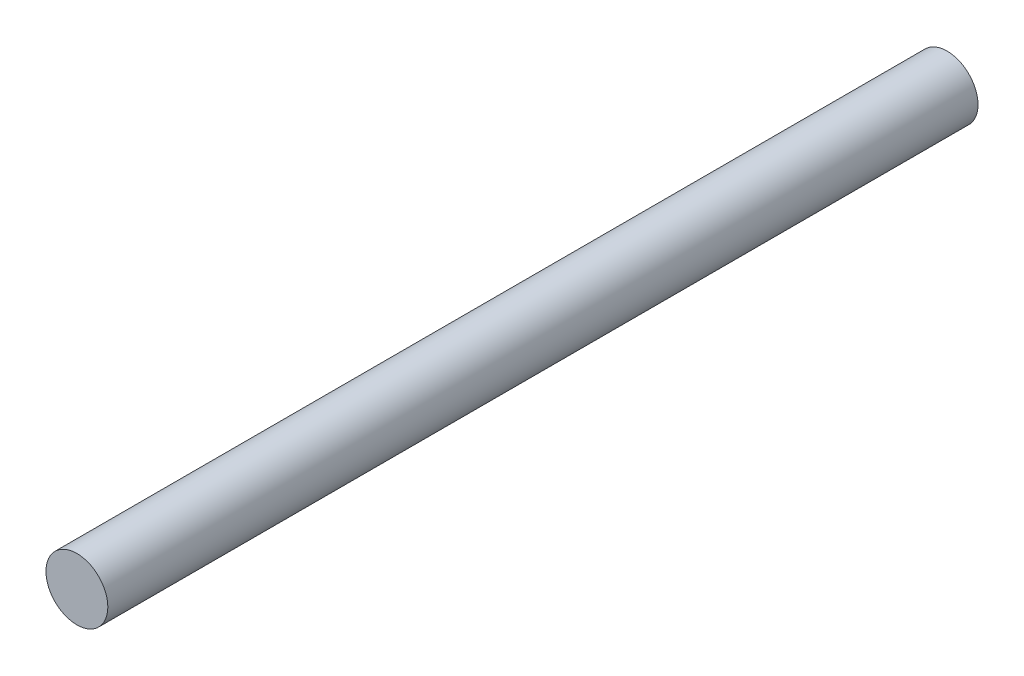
ISO-10303-21;
HEADER;
FILE_DESCRIPTION(('STEP AP214'),'2;1');
FILE_NAME('part.step','',(''),(''),'','','');
FILE_SCHEMA(('AUTOMOTIVE_DESIGN { 1 0 10303 214 1 1 1 1 }'));
ENDSEC;
DATA;
#1=APPLICATION_CONTEXT('core data for automotive mechanical design processes');
#2=APPLICATION_PROTOCOL_DEFINITION('international standard','automotive_design',2000,#1);
#3=PRODUCT_CONTEXT('',#1,'mechanical');
#4=PRODUCT('Part','Part','',(#3));
#5=PRODUCT_RELATED_PRODUCT_CATEGORY('part','',(#4));
#6=PRODUCT_DEFINITION_FORMATION('','',#4);
#7=PRODUCT_DEFINITION_CONTEXT('part definition',#1,'design');
#8=PRODUCT_DEFINITION('design','',#6,#7);
#9=PRODUCT_DEFINITION_SHAPE('','',#8);
#10=(LENGTH_UNIT() NAMED_UNIT(*) SI_UNIT(.MILLI.,.METRE.));
#11=(NAMED_UNIT(*) PLANE_ANGLE_UNIT() SI_UNIT($,.RADIAN.));
#12=(NAMED_UNIT(*) SI_UNIT($,.STERADIAN.) SOLID_ANGLE_UNIT());
#13=UNCERTAINTY_MEASURE_WITH_UNIT(LENGTH_MEASURE(1.E-05),#10,'distance_accuracy_value','');
#14=(GEOMETRIC_REPRESENTATION_CONTEXT(3) GLOBAL_UNCERTAINTY_ASSIGNED_CONTEXT((#13)) GLOBAL_UNIT_ASSIGNED_CONTEXT((#10,
#11,#12)) REPRESENTATION_CONTEXT('',''));
#15=CARTESIAN_POINT('',(0.,0.,0.));
#16=DIRECTION('',(0.,0.,1.));
#17=DIRECTION('',(1.,0.,0.));
#18=AXIS2_PLACEMENT_3D('',#15,#16,#17);
#19=CARTESIAN_POINT('',(0.,0.,450.));
#20=DIRECTION('',(0.,0.,-1.));
#21=DIRECTION('',(-1.,0.,0.));
#22=AXIS2_PLACEMENT_3D('',#19,#20,#21);
#23=CYLINDRICAL_SURFACE('',#22,16.);
#24=CARTESIAN_POINT('',(0.,0.,450.));
#25=DIRECTION('',(0.,0.,1.));
#26=DIRECTION('',(1.,0.,0.));
#27=AXIS2_PLACEMENT_3D('',#24,#25,#26);
#28=CIRCLE('',#27,16.);
#29=CARTESIAN_POINT('',(16.,0.,450.));
#30=VERTEX_POINT('',#29);
#31=EDGE_CURVE('E10',#30,#30,#28,.T.);
#32=ORIENTED_EDGE('',*,*,#31,.F.);
#33=EDGE_LOOP('',(#32));
#34=FACE_BOUND('',#33,.T.);
#35=CARTESIAN_POINT('',(0.,0.,0.));
#36=DIRECTION('',(0.,0.,1.));
#37=DIRECTION('',(1.,0.,0.));
#38=AXIS2_PLACEMENT_3D('',#35,#36,#37);
#39=CIRCLE('',#38,16.);
#40=CARTESIAN_POINT('',(16.,0.,0.));
#41=VERTEX_POINT('',#40);
#42=EDGE_CURVE('E33',#41,#41,#39,.T.);
#43=ORIENTED_EDGE('',*,*,#42,.T.);
#44=EDGE_LOOP('',(#43));
#45=FACE_BOUND('',#44,.T.);
#46=ADVANCED_FACE('F30',(#34,#45),#23,.T.);
#47=CARTESIAN_POINT('',(0.,0.,450.));
#48=DIRECTION('',(0.,0.,1.));
#49=DIRECTION('',(1.,0.,0.));
#50=AXIS2_PLACEMENT_3D('',#47,#48,#49);
#51=PLANE('',#50);
#52=ORIENTED_EDGE('',*,*,#31,.T.);
#53=EDGE_LOOP('',(#52));
#54=FACE_BOUND('',#53,.T.);
#55=ADVANCED_FACE('F45',(#54),#51,.T.);
#56=CARTESIAN_POINT('',(0.,0.,0.));
#57=DIRECTION('',(0.,0.,1.));
#58=DIRECTION('',(1.,0.,0.));
#59=AXIS2_PLACEMENT_3D('',#56,#57,#58);
#60=PLANE('',#59);
#61=ORIENTED_EDGE('',*,*,#42,.F.);
#62=EDGE_LOOP('',(#61));
#63=FACE_BOUND('',#62,.T.);
#64=ADVANCED_FACE('F43',(#63),#60,.F.);
#65=CLOSED_SHELL('',(#46,#55,#64));
#66=MANIFOLD_SOLID_BREP('B2',#65);
#67=ADVANCED_BREP_SHAPE_REPRESENTATION('',(#18,#66),#14);
#68=SHAPE_DEFINITION_REPRESENTATION(#9,#67);
ENDSEC;
END-ISO-10303-21;
